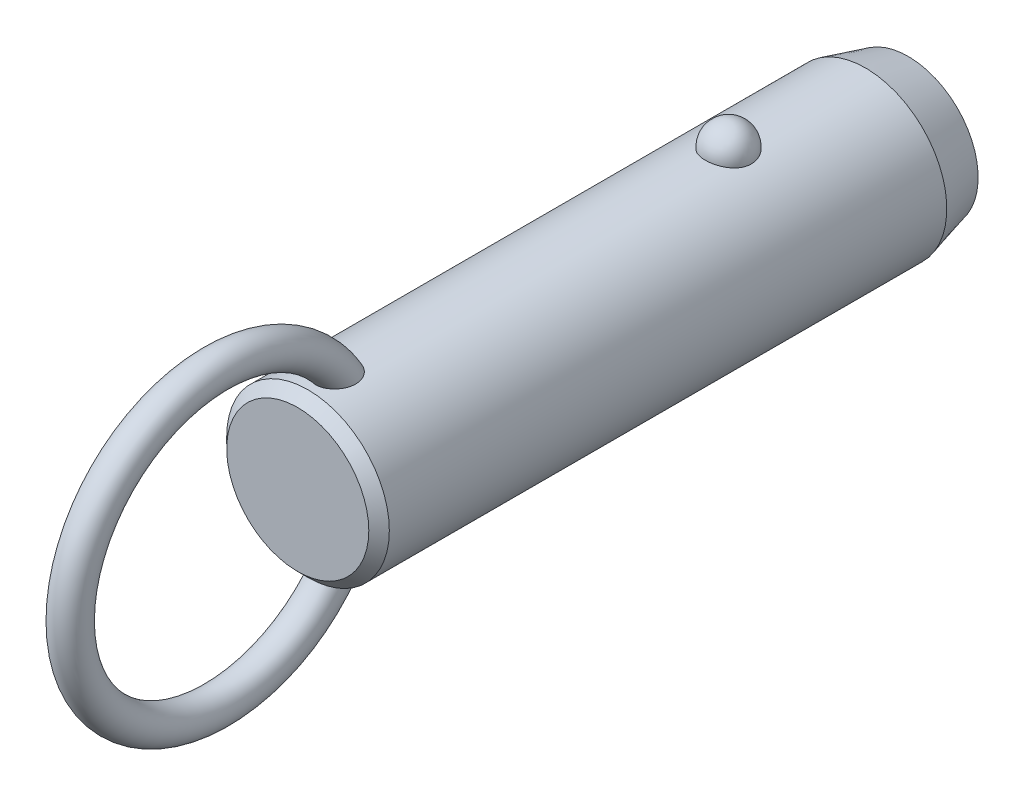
ISO-10303-21;
HEADER;
FILE_DESCRIPTION(('STEP AP214'),'2;1');
FILE_NAME('part.step','',(''),(''),'','','');
FILE_SCHEMA(('AUTOMOTIVE_DESIGN { 1 0 10303 214 1 1 1 1 }'));
ENDSEC;
DATA;
#1=APPLICATION_CONTEXT('core data for automotive mechanical design processes');
#2=APPLICATION_PROTOCOL_DEFINITION('international standard','automotive_design',2000,#1);
#3=PRODUCT_CONTEXT('',#1,'mechanical');
#4=PRODUCT('Part','Part','',(#3));
#5=PRODUCT_RELATED_PRODUCT_CATEGORY('part','',(#4));
#6=PRODUCT_DEFINITION_FORMATION('','',#4);
#7=PRODUCT_DEFINITION_CONTEXT('part definition',#1,'design');
#8=PRODUCT_DEFINITION('design','',#6,#7);
#9=PRODUCT_DEFINITION_SHAPE('','',#8);
#10=(LENGTH_UNIT() NAMED_UNIT(*) SI_UNIT(.MILLI.,.METRE.));
#11=(NAMED_UNIT(*) PLANE_ANGLE_UNIT() SI_UNIT($,.RADIAN.));
#12=(NAMED_UNIT(*) SI_UNIT($,.STERADIAN.) SOLID_ANGLE_UNIT());
#13=UNCERTAINTY_MEASURE_WITH_UNIT(LENGTH_MEASURE(1.E-05),#10,'distance_accuracy_value','');
#14=(GEOMETRIC_REPRESENTATION_CONTEXT(3) GLOBAL_UNCERTAINTY_ASSIGNED_CONTEXT((#13)) GLOBAL_UNIT_ASSIGNED_CONTEXT((#10,
#11,#12)) REPRESENTATION_CONTEXT('',''));
#15=CARTESIAN_POINT('',(0.,0.,0.));
#16=DIRECTION('',(0.,0.,1.));
#17=DIRECTION('',(1.,0.,0.));
#18=AXIS2_PLACEMENT_3D('',#15,#16,#17);
#19=CARTESIAN_POINT('',(0.,0.,38.1));
#20=DIRECTION('',(0.,0.,-1.));
#21=DIRECTION('',(-1.,0.,0.));
#22=AXIS2_PLACEMENT_3D('',#19,#20,#21);
#23=CYLINDRICAL_SURFACE('',#22,9.5);
#24=CARTESIAN_POINT('',(2.67259918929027,9.11631578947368,-2.70000000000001));
#25=CARTESIAN_POINT('',(2.6725968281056,9.11631786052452,-2.54909854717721));
#26=CARTESIAN_POINT('',(2.66030567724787,9.11994722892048,-2.39816735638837));
#27=CARTESIAN_POINT('',(2.6114347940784,9.13405924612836,-2.10058568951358));
#28=CARTESIAN_POINT('',(2.57484658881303,9.14454428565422,-1.95393672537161));
#29=CARTESIAN_POINT('',(2.47830875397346,9.17117631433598,-1.66916069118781));
#30=CARTESIAN_POINT('',(2.41836936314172,9.18732082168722,-1.53102991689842));
#31=CARTESIAN_POINT('',(2.27661331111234,9.22346780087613,-1.26705393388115));
#32=CARTESIAN_POINT('',(2.19479699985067,9.24347021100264,-1.14120852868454));
#33=CARTESIAN_POINT('',(2.01085282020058,9.28522401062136,-0.90463270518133));
#34=CARTESIAN_POINT('',(1.90862396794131,9.30698376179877,-0.793982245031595));
#35=CARTESIAN_POINT('',(1.6867437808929,9.34973971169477,-0.591607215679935));
#36=CARTESIAN_POINT('',(1.56709244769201,9.37073591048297,-0.499882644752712));
#37=CARTESIAN_POINT('',(1.31393976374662,9.40956370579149,-0.338167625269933));
#38=CARTESIAN_POINT('',(1.18048026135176,9.42740444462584,-0.268113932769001));
#39=CARTESIAN_POINT('',(0.903154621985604,9.45799906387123,-0.151390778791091));
#40=CARTESIAN_POINT('',(0.759289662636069,9.47075351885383,-0.104718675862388));
#41=CARTESIAN_POINT('',(0.468074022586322,9.48956256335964,-0.0367633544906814));
#42=CARTESIAN_POINT('',(0.320836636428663,9.49573643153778,-0.0150275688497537));
#43=CARTESIAN_POINT('',(0.0246714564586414,9.50112183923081,0.00396199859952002));
#44=CARTESIAN_POINT('',(-0.124256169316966,9.50033406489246,0.00121819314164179));
#45=CARTESIAN_POINT('',(-0.417264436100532,9.4919475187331,-0.0284441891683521));
#46=CARTESIAN_POINT('',(-0.56138413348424,9.48444885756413,-0.055007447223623));
#47=CARTESIAN_POINT('',(-0.842986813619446,9.46357853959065,-0.131064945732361));
#48=CARTESIAN_POINT('',(-0.980469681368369,9.450206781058,-0.180559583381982));
#49=CARTESIAN_POINT('',(-1.24585005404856,9.41890822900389,-0.301476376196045));
#50=CARTESIAN_POINT('',(-1.37368611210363,9.40095498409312,-0.373026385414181));
#51=CARTESIAN_POINT('',(-1.61552738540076,9.3624296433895,-0.536025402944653));
#52=CARTESIAN_POINT('',(-1.72953116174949,9.34185727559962,-0.627476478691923));
#53=CARTESIAN_POINT('',(-1.9429225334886,9.29984568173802,-0.82984483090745));
#54=CARTESIAN_POINT('',(-2.04198021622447,9.27839736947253,-0.941108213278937));
#55=CARTESIAN_POINT('',(-2.2202646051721,9.23735994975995,-1.17883414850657));
#56=CARTESIAN_POINT('',(-2.29948985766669,9.21777097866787,-1.30529781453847));
#57=CARTESIAN_POINT('',(-2.43697287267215,9.18238994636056,-1.57158566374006));
#58=CARTESIAN_POINT('',(-2.49497068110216,9.16664569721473,-1.71155057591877));
#59=CARTESIAN_POINT('',(-2.5872073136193,9.14104303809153,-1.99961197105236));
#60=CARTESIAN_POINT('',(-2.62144683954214,9.13118445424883,-2.14770821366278));
#61=CARTESIAN_POINT('',(-2.66521466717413,9.11850622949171,-2.44715424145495));
#62=CARTESIAN_POINT('',(-2.67484831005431,9.11565658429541,-2.59848735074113));
#63=CARTESIAN_POINT('',(-2.66946735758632,9.11723375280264,-2.90067317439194));
#64=CARTESIAN_POINT('',(-2.65445345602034,9.12166036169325,-3.05152590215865));
#65=CARTESIAN_POINT('',(-2.60029711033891,9.13724422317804,-3.34766110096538));
#66=CARTESIAN_POINT('',(-2.56127978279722,9.14836656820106,-3.49296833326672));
#67=CARTESIAN_POINT('',(-2.46018844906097,9.17606676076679,-3.77477535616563));
#68=CARTESIAN_POINT('',(-2.39811349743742,9.1926448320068,-3.9112747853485));
#69=CARTESIAN_POINT('',(-2.25202303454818,9.22952198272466,-4.17244273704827));
#70=CARTESIAN_POINT('',(-2.16788714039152,9.24984129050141,-4.29704106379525));
#71=CARTESIAN_POINT('',(-1.9799408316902,9.29188255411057,-4.53013066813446));
#72=CARTESIAN_POINT('',(-1.87612963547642,9.31360456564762,-4.63862130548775));
#73=CARTESIAN_POINT('',(-1.65105429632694,9.35612959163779,-4.8369029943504));
#74=CARTESIAN_POINT('',(-1.52972405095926,9.37692871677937,-4.92661991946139));
#75=CARTESIAN_POINT('',(-1.27318250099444,9.41518970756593,-5.08429106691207));
#76=CARTESIAN_POINT('',(-1.13797219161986,9.432651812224,-5.15224684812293));
#77=CARTESIAN_POINT('',(-0.859280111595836,9.46208255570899,-5.26371827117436));
#78=CARTESIAN_POINT('',(-0.715925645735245,9.47411833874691,-5.30753421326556));
#79=CARTESIAN_POINT('',(-0.423550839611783,9.4916822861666,-5.37076321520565));
#80=CARTESIAN_POINT('',(-0.274531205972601,9.49721125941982,-5.39017930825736));
#81=CARTESIAN_POINT('',(0.0218446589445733,9.50110860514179,-5.40390587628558));
#82=CARTESIAN_POINT('',(0.169177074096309,9.49961381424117,-5.39869609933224));
#83=CARTESIAN_POINT('',(0.460808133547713,9.48993906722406,-5.36441955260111));
#84=CARTESIAN_POINT('',(0.605106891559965,9.48175936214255,-5.33535367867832));
#85=CARTESIAN_POINT('',(0.886027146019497,9.4596376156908,-5.25435587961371));
#86=CARTESIAN_POINT('',(1.02267710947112,9.44571881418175,-5.20251612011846));
#87=CARTESIAN_POINT('',(1.28523827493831,9.41358993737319,-5.07741549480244));
#88=CARTESIAN_POINT('',(1.41114877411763,9.39537958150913,-5.00415322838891));
#89=CARTESIAN_POINT('',(1.65085227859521,9.3562644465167,-4.83684599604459));
#90=CARTESIAN_POINT('',(1.76442346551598,9.33532178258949,-4.74249218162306));
#91=CARTESIAN_POINT('',(1.97425672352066,9.29321198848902,-4.53620389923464));
#92=CARTESIAN_POINT('',(2.07051582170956,9.27204482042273,-4.42426641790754));
#93=CARTESIAN_POINT('',(2.24490086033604,9.23139221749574,-4.18363183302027));
#94=CARTESIAN_POINT('',(2.32267019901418,9.21194380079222,-4.05466990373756));
#95=CARTESIAN_POINT('',(2.45584092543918,9.1773419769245,-3.78517836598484));
#96=CARTESIAN_POINT('',(2.5112497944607,9.16218713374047,-3.64465264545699));
#97=CARTESIAN_POINT('',(2.59380876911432,9.13913522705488,-3.37104301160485));
#98=CARTESIAN_POINT('',(2.62330266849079,9.13064624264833,-3.23871053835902));
#99=CARTESIAN_POINT('',(2.66269870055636,9.11923566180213,-2.97092664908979));
#100=CARTESIAN_POINT('',(2.67260130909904,9.11631393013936,-2.83547530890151));
#101=CARTESIAN_POINT('',(2.67259918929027,9.11631578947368,-2.70000000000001));
#102=B_SPLINE_CURVE_WITH_KNOTS('',3,(#24,#25,#26,#27,#28,#29,#30,#31,#32,#33,#34,#35,#36,#37,
#38,#39,#40,#41,#42,#43,#44,#45,#46,#47,#48,#49,#50,#51,#52,#53,#54,#55,#56,#57,#58,#59,#60,#61,
#62,#63,#64,#65,#66,#67,#68,#69,#70,#71,#72,#73,#74,#75,#76,#77,#78,#79,#80,#81,#82,#83,#84,#85,
#86,#87,#88,#89,#90,#91,#92,#93,#94,#95,#96,#97,#98,#99,#100,#101),.UNSPECIFIED.,.T.,.F.,(4,2,2,
2,2,2,2,2,2,2,2,2,2,2,2,2,2,2,2,2,2,2,2,2,2,2,2,2,2,2,2,2,2,2,2,2,2,2,4),(0.,0.452217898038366,
0.904593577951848,1.35677112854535,1.80894144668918,2.26340676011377,2.71787203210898,
3.17099820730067,3.62407318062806,4.0687883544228,4.51345969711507,4.95160616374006,
5.38976021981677,5.83050358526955,6.27129275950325,6.72071308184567,7.17016633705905,
7.62495278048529,8.07972578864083,8.53254856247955,8.98535859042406,9.43582813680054,
9.88631615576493,10.3393155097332,10.7923328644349,11.2471065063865,11.7018475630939,
12.150795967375,12.599688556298,13.0398725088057,13.4800399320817,13.9184421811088,
14.3568730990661,14.802202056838,15.2476074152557,15.7010097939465,16.1542603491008,
16.5602594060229,16.966248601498),.UNSPECIFIED.);
#103=CARTESIAN_POINT('',(2.67259918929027,9.11631578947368,-2.70000000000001));
#104=VERTEX_POINT('',#103);
#105=EDGE_CURVE('E41',#104,#104,#102,.T.);
#106=ORIENTED_EDGE('',*,*,#105,.T.);
#107=EDGE_LOOP('',(#106));
#108=FACE_BOUND('',#107,.T.);
#109=CARTESIAN_POINT('',(0.,0.,46.4200000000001));
#110=DIRECTION('',(0.,0.,1.));
#111=DIRECTION('',(1.,0.,0.));
#112=AXIS2_PLACEMENT_3D('',#109,#110,#111);
#113=CIRCLE('',#112,9.5);
#114=CARTESIAN_POINT('',(9.5,0.,46.4200000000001));
#115=VERTEX_POINT('',#114);
#116=EDGE_CURVE('E10',#115,#115,#113,.F.);
#117=ORIENTED_EDGE('',*,*,#116,.T.);
#118=EDGE_LOOP('',(#117));
#119=FACE_BOUND('',#118,.T.);
#120=CARTESIAN_POINT('',(-0.697062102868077,-9.47439269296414,40.7678088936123));
#121=CARTESIAN_POINT('',(-0.799579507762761,-9.46685146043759,40.8074823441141));
#122=CARTESIAN_POINT('',(-0.898575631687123,-9.45788043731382,40.8559309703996));
#123=CARTESIAN_POINT('',(-1.08670047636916,-9.43811593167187,40.9688685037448));
#124=CARTESIAN_POINT('',(-1.17583204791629,-9.42732297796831,41.0333527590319));
#125=CARTESIAN_POINT('',(-1.34179806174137,-9.40513672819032,41.1762099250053));
#126=CARTESIAN_POINT('',(-1.41865133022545,-9.39374438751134,41.254561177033));
#127=CARTESIAN_POINT('',(-1.5586004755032,-9.37154196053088,41.4227524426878));
#128=CARTESIAN_POINT('',(-1.62169476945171,-9.3607319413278,41.5125937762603));
#129=CARTESIAN_POINT('',(-1.73527695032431,-9.34035749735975,41.7045001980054));
#130=CARTESIAN_POINT('',(-1.7852226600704,-9.33085270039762,41.8068910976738));
#131=CARTESIAN_POINT('',(-1.86924997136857,-9.3143834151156,42.018148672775));
#132=CARTESIAN_POINT('',(-1.90332570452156,-9.30741986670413,42.1270177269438));
#133=CARTESIAN_POINT('',(-1.95893603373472,-9.29588482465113,42.3604730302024));
#134=CARTESIAN_POINT('',(-1.97872420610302,-9.29165182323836,42.4854890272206));
#135=CARTESIAN_POINT('',(-2.00062129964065,-9.28695978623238,42.7370805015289));
#136=CARTESIAN_POINT('',(-2.00272284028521,-9.28650232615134,42.863656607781));
#137=CARTESIAN_POINT('',(-1.98958876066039,-9.28932750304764,43.1368157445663));
#138=CARTESIAN_POINT('',(-1.97143366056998,-9.2932400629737,43.2832519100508));
#139=CARTESIAN_POINT('',(-1.91479925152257,-9.30507151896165,43.5720629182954));
#140=CARTESIAN_POINT('',(-1.87629122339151,-9.31299607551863,43.714431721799));
#141=CARTESIAN_POINT('',(-1.7722568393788,-9.33340232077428,44.0151725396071));
#142=CARTESIAN_POINT('',(-1.70334898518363,-9.34641636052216,44.1723691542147));
#143=CARTESIAN_POINT('',(-1.58111062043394,-9.36759153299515,44.3975171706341));
#144=CARTESIAN_POINT('',(-1.53721459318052,-9.3749261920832,44.4707968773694));
#145=CARTESIAN_POINT('',(-1.4430263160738,-9.38988566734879,44.6130740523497));
#146=CARTESIAN_POINT('',(-1.39273721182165,-9.39751033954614,44.6820736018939));
#147=CARTESIAN_POINT('',(-1.26775962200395,-9.41530678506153,44.8369832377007));
#148=CARTESIAN_POINT('',(-1.19052326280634,-9.42548108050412,44.9208712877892));
#149=CARTESIAN_POINT('',(-1.02420241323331,-9.44499825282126,45.0760086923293));
#150=CARTESIAN_POINT('',(-0.935139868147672,-9.45434261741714,45.1472808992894));
#151=CARTESIAN_POINT('',(-0.766610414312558,-9.46930670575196,45.2586955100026));
#152=CARTESIAN_POINT('',(-0.689439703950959,-9.47529223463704,45.3022354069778));
#153=CARTESIAN_POINT('',(-0.528942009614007,-9.48560294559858,45.3763133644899));
#154=CARTESIAN_POINT('',(-0.445620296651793,-9.48992953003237,45.4068624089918));
#155=CARTESIAN_POINT('',(-0.273901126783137,-9.49644161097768,45.4525792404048));
#156=CARTESIAN_POINT('',(-0.185465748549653,-9.49860811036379,45.46761059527));
#157=CARTESIAN_POINT('',(-0.00734541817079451,-9.5004135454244,45.4801494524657));
#158=CARTESIAN_POINT('',(0.0823387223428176,-9.50005405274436,45.4776678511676));
#159=CARTESIAN_POINT('',(0.247679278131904,-9.49708301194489,45.4569959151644));
#160=CARTESIAN_POINT('',(0.323620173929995,-9.49477609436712,45.4409300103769));
#161=CARTESIAN_POINT('',(0.471981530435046,-9.48855917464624,45.3971726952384));
#162=CARTESIAN_POINT('',(0.544400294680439,-9.48464840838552,45.3694757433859));
#163=CARTESIAN_POINT('',(0.708947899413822,-9.47398336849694,45.2928026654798));
#164=CARTESIAN_POINT('',(0.799149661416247,-9.46671310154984,45.2397745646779));
#165=CARTESIAN_POINT('',(0.969783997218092,-9.45076225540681,45.1199731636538));
#166=CARTESIAN_POINT('',(1.05019415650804,-9.44207854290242,45.0531692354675));
#167=CARTESIAN_POINT('',(1.23092343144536,-9.42051459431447,44.8807596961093));
#168=CARTESIAN_POINT('',(1.32652499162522,-9.40733378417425,44.7702619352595));
#169=CARTESIAN_POINT('',(1.49893121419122,-9.38140745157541,44.5355614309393));
#170=CARTESIAN_POINT('',(1.57571616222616,-9.36866239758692,44.4113445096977));
#171=CARTESIAN_POINT('',(1.71285426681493,-9.34457644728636,44.1493891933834));
#172=CARTESIAN_POINT('',(1.77266365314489,-9.33328726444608,44.0113623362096));
#173=CARTESIAN_POINT('',(1.87239208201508,-9.31379209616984,43.7280515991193));
#174=CARTESIAN_POINT('',(1.91230158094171,-9.3055875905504,43.582764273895));
#175=CARTESIAN_POINT('',(1.9760418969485,-9.29228394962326,43.2620281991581));
#176=CARTESIAN_POINT('',(1.99587438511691,-9.28797202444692,43.0857248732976));
#177=CARTESIAN_POINT('',(2.0029570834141,-9.28645519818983,42.7324146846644));
#178=CARTESIAN_POINT('',(1.99025930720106,-9.28923895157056,42.5554093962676));
#179=CARTESIAN_POINT('',(1.93735479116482,-9.30038134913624,42.2563381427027));
#180=CARTESIAN_POINT('',(1.90576827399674,-9.30697680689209,42.1326679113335));
#181=CARTESIAN_POINT('',(1.82287484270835,-9.32356855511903,41.8923297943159));
#182=CARTESIAN_POINT('',(1.77158213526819,-9.33356239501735,41.7756569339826));
#183=CARTESIAN_POINT('',(1.64885744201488,-9.35602275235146,41.5527061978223));
#184=CARTESIAN_POINT('',(1.57730995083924,-9.36850332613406,41.4464927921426));
#185=CARTESIAN_POINT('',(1.41543264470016,-9.39431873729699,41.2495530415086));
#186=CARTESIAN_POINT('',(1.32510883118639,-9.40765330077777,41.1588217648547));
#187=CARTESIAN_POINT('',(1.13846223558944,-9.43195720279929,41.0050334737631));
#188=CARTESIAN_POINT('',(1.04369890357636,-9.44302894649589,40.9400947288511));
#189=CARTESIAN_POINT('',(0.843965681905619,-9.46296805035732,40.8280388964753));
#190=CARTESIAN_POINT('',(0.739000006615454,-9.4718363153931,40.7809144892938));
#191=CARTESIAN_POINT('',(0.528175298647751,-9.48586140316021,40.7081173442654));
#192=CARTESIAN_POINT('',(0.422686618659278,-9.49119633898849,40.6814024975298));
#193=CARTESIAN_POINT('',(0.2085901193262,-9.49831365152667,40.6460137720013));
#194=CARTESIAN_POINT('',(0.0999817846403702,-9.500095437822,40.6373428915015));
#195=CARTESIAN_POINT('',(-0.126104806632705,-9.49988861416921,40.6383501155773));
#196=CARTESIAN_POINT('',(-0.243578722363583,-9.49757821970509,40.6495942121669));
#197=CARTESIAN_POINT('',(-0.474390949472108,-9.48885165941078,40.693167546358));
#198=CARTESIAN_POINT('',(-0.587729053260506,-9.48243528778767,40.7254978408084));
#199=CARTESIAN_POINT('',(-0.697062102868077,-9.47439269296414,40.7678088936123));
#200=B_SPLINE_CURVE_WITH_KNOTS('',3,(#120,#121,#122,#123,#124,#125,#126,#127,#128,#129,#130,
#131,#132,#133,#134,#135,#136,#137,#138,#139,#140,#141,#142,#143,#144,#145,#146,#147,#148,#149,
#150,#151,#152,#153,#154,#155,#156,#157,#158,#159,#160,#161,#162,#163,#164,#165,#166,#167,#168,
#169,#170,#171,#172,#173,#174,#175,#176,#177,#178,#179,#180,#181,#182,#183,#184,#185,#186,#187,
#188,#189,#190,#191,#192,#193,#194,#195,#196,#197,#198,#199),.UNSPECIFIED.,.T.,.F.,(4,2,2,2,2,2,
2,2,2,2,2,2,2,2,2,2,2,2,2,2,2,2,2,2,2,2,2,2,2,2,2,2,2,2,2,2,2,2,2,4),(0.,0.330119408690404,
0.660143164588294,0.989655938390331,1.31920659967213,1.66074728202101,2.00241415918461,
2.38088696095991,2.75951768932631,3.20065679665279,3.64242004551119,4.15620996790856,
4.4131416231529,4.66994734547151,5.0122866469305,5.35399933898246,5.6194303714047,
5.88463652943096,6.15215502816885,6.41950709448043,6.65144391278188,6.88349136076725,
7.19641200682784,7.5100360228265,7.94779711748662,8.38601491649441,8.83699707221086,
9.2881953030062,9.81778662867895,10.3465317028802,10.7284172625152,11.110028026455,
11.4938603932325,11.8775702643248,12.2220189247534,12.5663259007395,12.8915939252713,
13.2169159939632,13.5689650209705,13.9210316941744),.UNSPECIFIED.);
#201=CARTESIAN_POINT('',(-0.697062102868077,-9.47439269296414,40.7678088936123));
#202=VERTEX_POINT('',#201);
#203=EDGE_CURVE('E59',#202,#202,#200,.T.);
#204=ORIENTED_EDGE('',*,*,#203,.T.);
#205=EDGE_LOOP('',(#204));
#206=FACE_BOUND('',#205,.T.);
#207=CARTESIAN_POINT('',(-0.697062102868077,9.47439269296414,40.7678088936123));
#208=CARTESIAN_POINT('',(-0.597792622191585,9.48169483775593,40.7293956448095));
#209=CARTESIAN_POINT('',(-0.495106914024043,9.48766580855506,40.6991682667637));
#210=CARTESIAN_POINT('',(-0.285876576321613,9.49627648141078,40.6560327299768));
#211=CARTESIAN_POINT('',(-0.179324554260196,9.49890941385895,40.6431597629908));
#212=CARTESIAN_POINT('',(0.0344157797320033,9.50053798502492,40.6351666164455));
#213=CARTESIAN_POINT('',(0.141603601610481,9.49953613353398,40.6400341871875));
#214=CARTESIAN_POINT('',(0.35356357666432,9.49401038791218,40.6673654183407));
#215=CARTESIAN_POINT('',(0.458336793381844,9.48948807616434,40.68982117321));
#216=CARTESIAN_POINT('',(0.662493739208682,9.4774236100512,40.7516719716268));
#217=CARTESIAN_POINT('',(0.76188104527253,9.46988348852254,40.7910556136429));
#218=CARTESIAN_POINT('',(0.952608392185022,9.45260382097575,40.8856342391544));
#219=CARTESIAN_POINT('',(1.04394806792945,9.44286417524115,40.9408299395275));
#220=CARTESIAN_POINT('',(1.21712767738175,9.4221176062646,41.0660662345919));
#221=CARTESIAN_POINT('',(1.29885671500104,9.41109835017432,41.1362579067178));
#222=CARTESIAN_POINT('',(1.44978975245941,9.38903310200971,41.288980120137));
#223=CARTESIAN_POINT('',(1.51899278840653,9.37798710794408,41.3715116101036));
#224=CARTESIAN_POINT('',(1.64602857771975,9.35654375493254,41.5497763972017));
#225=CARTESIAN_POINT('',(1.70333052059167,9.34618688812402,41.6458916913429));
#226=CARTESIAN_POINT('',(1.80259341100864,9.32755128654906,41.845897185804));
#227=CARTESIAN_POINT('',(1.84454942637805,9.31927322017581,41.9497898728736));
#228=CARTESIAN_POINT('',(1.91637039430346,9.30478365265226,42.172213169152));
#229=CARTESIAN_POINT('',(1.944805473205,9.29882552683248,42.2912192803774));
#230=CARTESIAN_POINT('',(1.98449865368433,9.29043398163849,42.5321436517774));
#231=CARTESIAN_POINT('',(1.99574908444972,9.28800213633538,42.6540631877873));
#232=CARTESIAN_POINT('',(2.00275141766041,9.28649645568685,42.9169324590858));
#233=CARTESIAN_POINT('',(1.99588238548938,9.28799035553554,43.0579529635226));
#234=CARTESIAN_POINT('',(1.96270559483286,9.29505517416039,43.3376217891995));
#235=CARTESIAN_POINT('',(1.93637872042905,9.30063010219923,43.476267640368));
#236=CARTESIAN_POINT('',(1.85949176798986,9.31633564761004,43.7725616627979));
#237=CARTESIAN_POINT('',(1.80549792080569,9.3270926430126,43.9292907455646));
#238=CARTESIAN_POINT('',(1.67376869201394,9.3516306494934,44.2322840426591));
#239=CARTESIAN_POINT('',(1.59603181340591,9.36541185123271,44.3785475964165));
#240=CARTESIAN_POINT('',(1.4360277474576,9.39110706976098,44.6258138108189));
#241=CARTESIAN_POINT('',(1.35831795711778,9.40278656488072,44.729791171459));
#242=CARTESIAN_POINT('',(1.18774483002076,9.42585025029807,44.9245347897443));
#243=CARTESIAN_POINT('',(1.09490932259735,9.43723493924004,45.0153247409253));
#244=CARTESIAN_POINT('',(0.921110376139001,9.45552616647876,45.1562033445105));
#245=CARTESIAN_POINT('',(0.843738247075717,9.46281058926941,45.2106563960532));
#246=CARTESIAN_POINT('',(0.681245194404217,9.47589120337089,45.3067117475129));
#247=CARTESIAN_POINT('',(0.596135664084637,9.48168953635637,45.3483325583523));
#248=CARTESIAN_POINT('',(0.43377914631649,9.49038144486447,45.4100899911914));
#249=CARTESIAN_POINT('',(0.357459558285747,9.49359170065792,45.4326013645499));
#250=CARTESIAN_POINT('',(0.20207411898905,9.49816761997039,45.4645745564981));
#251=CARTESIAN_POINT('',(0.123010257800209,9.49953459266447,45.4740456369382));
#252=CARTESIAN_POINT('',(-0.0357372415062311,9.50026497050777,45.4791143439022));
#253=CARTESIAN_POINT('',(-0.115421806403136,9.49962433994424,45.4746840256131));
#254=CARTESIAN_POINT('',(-0.272823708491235,9.49640854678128,45.4522962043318));
#255=CARTESIAN_POINT('',(-0.350540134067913,9.4938325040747,45.4343325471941));
#256=CARTESIAN_POINT('',(-0.500580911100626,9.4870946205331,45.3868028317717));
#257=CARTESIAN_POINT('',(-0.572979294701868,9.48296359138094,45.3574618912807));
#258=CARTESIAN_POINT('',(-0.712864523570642,9.47347609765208,45.2890087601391));
#259=CARTESIAN_POINT('',(-0.780349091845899,9.46811906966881,45.2498920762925));
#260=CARTESIAN_POINT('',(-0.946309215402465,9.45329720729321,45.139432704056));
#261=CARTESIAN_POINT('',(-1.04090230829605,9.44321512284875,45.0623297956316));
#262=CARTESIAN_POINT('',(-1.21661929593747,9.42219227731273,44.8940971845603));
#263=CARTESIAN_POINT('',(-1.29770519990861,9.41124921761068,44.8029292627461));
#264=CARTESIAN_POINT('',(-1.47319646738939,9.38563439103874,44.5761621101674));
#265=CARTESIAN_POINT('',(-1.56208878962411,9.37102009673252,44.4362895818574));
#266=CARTESIAN_POINT('',(-1.71623987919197,9.34401559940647,44.1439503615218));
#267=CARTESIAN_POINT('',(-1.78147866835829,9.33162728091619,43.9914731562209));
#268=CARTESIAN_POINT('',(-1.88853837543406,9.31055541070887,43.6756470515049));
#269=CARTESIAN_POINT('',(-1.92998995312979,9.30193076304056,43.5121685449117));
#270=CARTESIAN_POINT('',(-1.98590726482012,9.29015757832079,43.1805268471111));
#271=CARTESIAN_POINT('',(-2.0004070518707,9.2870021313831,43.0123698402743));
#272=CARTESIAN_POINT('',(-1.99964701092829,9.28716218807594,42.7050806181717));
#273=CARTESIAN_POINT('',(-1.98908145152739,9.28945704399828,42.5659362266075));
#274=CARTESIAN_POINT('',(-1.94566294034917,9.29865169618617,42.2911539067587));
#275=CARTESIAN_POINT('',(-1.91282062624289,9.30554929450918,42.155514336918));
#276=CARTESIAN_POINT('',(-1.84582133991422,9.31898248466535,41.9578026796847));
#277=CARTESIAN_POINT('',(-1.8203808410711,9.32400364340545,41.892583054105));
#278=CARTESIAN_POINT('',(-1.7635051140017,9.33492884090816,41.7649033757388));
#279=CARTESIAN_POINT('',(-1.7320730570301,9.34083241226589,41.7024418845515));
#280=CARTESIAN_POINT('',(-1.66324243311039,9.353333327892,41.5809407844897));
#281=CARTESIAN_POINT('',(-1.62584239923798,9.35993084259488,41.5219020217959));
#282=CARTESIAN_POINT('',(-1.54527678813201,9.37356864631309,41.4079875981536));
#283=CARTESIAN_POINT('',(-1.50211241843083,9.38060884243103,41.3531110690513));
#284=CARTESIAN_POINT('',(-1.37681147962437,9.40004442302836,41.2099619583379));
#285=CARTESIAN_POINT('',(-1.28916358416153,9.41261047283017,41.1264295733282));
#286=CARTESIAN_POINT('',(-1.09996826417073,9.43658180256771,40.9772360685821));
#287=CARTESIAN_POINT('',(-0.998461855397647,9.44799034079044,40.9115238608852));
#288=CARTESIAN_POINT('',(-0.860188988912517,9.46103017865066,40.8394367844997));
#289=CARTESIAN_POINT('',(-0.828141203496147,9.46389141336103,40.8238511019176));
#290=CARTESIAN_POINT('',(-0.763210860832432,9.46934915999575,40.7944734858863));
#291=CARTESIAN_POINT('',(-0.730328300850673,9.47194567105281,40.7806815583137));
#292=CARTESIAN_POINT('',(-0.697062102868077,9.47439269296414,40.7678088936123));
#293=B_SPLINE_CURVE_WITH_KNOTS('',3,(#207,#208,#209,#210,#211,#212,#213,#214,#215,#216,#217,
#218,#219,#220,#221,#222,#223,#224,#225,#226,#227,#228,#229,#230,#231,#232,#233,#234,#235,#236,
#237,#238,#239,#240,#241,#242,#243,#244,#245,#246,#247,#248,#249,#250,#251,#252,#253,#254,#255,
#256,#257,#258,#259,#260,#261,#262,#263,#264,#265,#266,#267,#268,#269,#270,#271,#272,#273,#274,
#275,#276,#277,#278,#279,#280,#281,#282,#283,#284,#285,#286,#287,#288,#289,#290,#291,#292),
.UNSPECIFIED.,.T.,.F.,(4,2,2,2,2,2,2,2,2,2,2,2,2,2,2,2,2,2,2,2,2,2,2,2,2,2,2,2,2,2,2,2,2,2,2,2,
2,2,2,2,2,2,4),(0.,0.319942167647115,0.640532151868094,0.960900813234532,1.28112555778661,
1.60113495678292,1.92115886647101,2.24457323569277,2.56801248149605,2.90371927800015,
3.23953387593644,3.60560313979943,3.97183576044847,4.393836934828,4.81625324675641,
5.31257045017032,5.80891895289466,6.19868344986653,6.58773876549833,6.87145417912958,
7.15475838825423,7.3926375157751,7.63034760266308,7.86853584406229,8.10683246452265,
8.3406366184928,8.57454843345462,8.93983939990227,9.30614105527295,9.80266668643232,
10.2996107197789,10.8040753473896,11.3079021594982,11.7249776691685,12.1418541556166,
12.3521485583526,12.562331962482,12.7725671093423,12.9827582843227,13.3458276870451,
13.7078449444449,13.8150604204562,13.9222762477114),.UNSPECIFIED.);
#294=CARTESIAN_POINT('',(-0.697062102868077,9.47439269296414,40.7678088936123));
#295=VERTEX_POINT('',#294);
#296=EDGE_CURVE('E67',#295,#295,#293,.T.);
#297=ORIENTED_EDGE('',*,*,#296,.T.);
#298=EDGE_LOOP('',(#297));
#299=FACE_BOUND('',#298,.T.);
#300=CARTESIAN_POINT('',(0.,0.,-18.7));
#301=DIRECTION('',(0.,0.,-1.));
#302=DIRECTION('',(-1.,0.,0.));
#303=AXIS2_PLACEMENT_3D('',#300,#301,#302);
#304=CIRCLE('',#303,9.5);
#305=CARTESIAN_POINT('',(-9.5,0.,-18.7));
#306=VERTEX_POINT('',#305);
#307=EDGE_CURVE('E56',#306,#306,#304,.F.);
#308=ORIENTED_EDGE('',*,*,#307,.T.);
#309=EDGE_LOOP('',(#308));
#310=FACE_BOUND('',#309,.T.);
#311=ADVANCED_FACE('F37',(#108,#119,#206,#299,#310),#23,.T.);
#312=CARTESIAN_POINT('',(0.,0.,-23.7));
#313=DIRECTION('',(0.,0.,-1.));
#314=DIRECTION('',(-1.,0.,0.));
#315=AXIS2_PLACEMENT_3D('',#312,#313,#314);
#316=PLANE('',#315);
#317=CARTESIAN_POINT('',(0.,0.,-23.7));
#318=DIRECTION('',(0.,0.,-1.));
#319=DIRECTION('',(-1.,0.,0.));
#320=AXIS2_PLACEMENT_3D('',#317,#318,#319);
#321=CIRCLE('',#320,8.1602540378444);
#322=CARTESIAN_POINT('',(-8.1602540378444,0.,-23.7));
#323=VERTEX_POINT('',#322);
#324=EDGE_CURVE('E66',#323,#323,#321,.T.);
#325=ORIENTED_EDGE('',*,*,#324,.T.);
#326=EDGE_LOOP('',(#325));
#327=FACE_BOUND('',#326,.T.);
#328=ADVANCED_FACE('F85',(#327),#316,.T.);
#329=CARTESIAN_POINT('',(0.,0.,-23.7));
#330=DIRECTION('',(0.,0.,1.));
#331=DIRECTION('',(1.,0.,0.));
#332=AXIS2_PLACEMENT_3D('',#329,#330,#331);
#333=CONICAL_SURFACE('',#332,8.1602540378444,0.261799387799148);
#334=ORIENTED_EDGE('',*,*,#307,.F.);
#335=EDGE_LOOP('',(#334));
#336=FACE_BOUND('',#335,.T.);
#337=ORIENTED_EDGE('',*,*,#324,.F.);
#338=EDGE_LOOP('',(#337));
#339=FACE_BOUND('',#338,.T.);
#340=ADVANCED_FACE('F83',(#336,#339),#333,.T.);
#341=CARTESIAN_POINT('',(0.,0.,47.62));
#342=DIRECTION('',(0.,0.,1.));
#343=DIRECTION('',(1.,0.,0.));
#344=AXIS2_PLACEMENT_3D('',#341,#342,#343);
#345=PLANE('',#344);
#346=CARTESIAN_POINT('',(0.,0.,47.62));
#347=DIRECTION('',(0.,0.,1.));
#348=DIRECTION('',(1.,0.,0.));
#349=AXIS2_PLACEMENT_3D('',#346,#347,#348);
#350=CIRCLE('',#349,8.30000000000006);
#351=CARTESIAN_POINT('',(8.30000000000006,0.,47.62));
#352=VERTEX_POINT('',#351);
#353=EDGE_CURVE('E50',#352,#352,#350,.T.);
#354=ORIENTED_EDGE('',*,*,#353,.T.);
#355=EDGE_LOOP('',(#354));
#356=FACE_BOUND('',#355,.T.);
#357=ADVANCED_FACE('F77',(#356),#345,.T.);
#358=CARTESIAN_POINT('',(0.,0.,57.15));
#359=DIRECTION('',(1.,0.,0.));
#360=DIRECTION('',(0.,0.,-1.));
#361=AXIS2_PLACEMENT_3D('',#358,#359,#360);
#362=TOROIDAL_SURFACE('',#361,17.05,2.);
#363=ORIENTED_EDGE('',*,*,#296,.F.);
#364=EDGE_LOOP('',(#363));
#365=FACE_BOUND('',#364,.T.);
#366=ORIENTED_EDGE('',*,*,#203,.F.);
#367=EDGE_LOOP('',(#366));
#368=FACE_BOUND('',#367,.T.);
#369=ADVANCED_FACE('F73',(#365,#368),#362,.T.);
#370=CARTESIAN_POINT('',(0.,0.,47.62));
#371=DIRECTION('',(0.,0.,-1.));
#372=DIRECTION('',(-1.,0.,0.));
#373=AXIS2_PLACEMENT_3D('',#370,#371,#372);
#374=CONICAL_SURFACE('',#373,8.30000000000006,0.785398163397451);
#375=ORIENTED_EDGE('',*,*,#116,.F.);
#376=EDGE_LOOP('',(#375));
#377=FACE_BOUND('',#376,.T.);
#378=ORIENTED_EDGE('',*,*,#353,.F.);
#379=EDGE_LOOP('',(#378));
#380=FACE_BOUND('',#379,.T.);
#381=ADVANCED_FACE('F39',(#377,#380),#374,.T.);
#382=CARTESIAN_POINT('',(0.,9.5,-2.7));
#383=DIRECTION('',(0.,1.,0.));
#384=DIRECTION('',(0.,0.,-1.));
#385=AXIS2_PLACEMENT_3D('',#382,#383,#384);
#386=SPHERICAL_SURFACE('',#385,2.7);
#387=ORIENTED_EDGE('',*,*,#105,.F.);
#388=EDGE_LOOP('',(#387));
#389=FACE_BOUND('',#388,.T.);
#390=ADVANCED_FACE('F79',(#389),#386,.T.);
#391=CLOSED_SHELL('',(#311,#328,#340,#357,#369,#381,#390));
#392=MANIFOLD_SOLID_BREP('B2',#391);
#393=ADVANCED_BREP_SHAPE_REPRESENTATION('',(#18,#392),#14);
#394=SHAPE_DEFINITION_REPRESENTATION(#9,#393);
ENDSEC;
END-ISO-10303-21;
